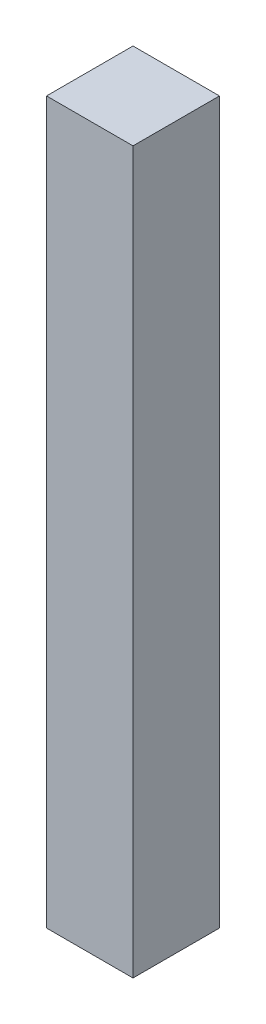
from build123d import *

# Parameters (mm, degrees)
ESQUISSE1_W        = 240
ESQUISSE1_H        = 240
BOSS_EXTRU_1_DEPTH = 2000


with BuildPart() as part:
    # Esquisse1 → Boss.-Extru.1 (new body)
    with BuildSketch(Plane(origin=(0, 0, 0), x_dir=(1, 0, 0), z_dir=(0, 1, 0))):
        Rectangle(ESQUISSE1_W, ESQUISSE1_H)
    extrude(amount=BOSS_EXTRU_1_DEPTH)


solid = part.part
